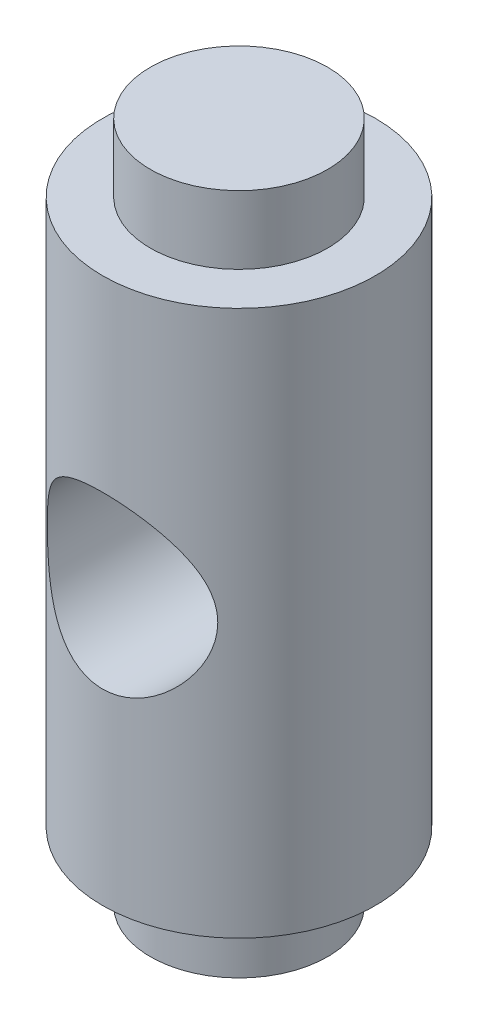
from build123d import *

# Parameters (mm, degrees)
M14X1_5_TAPPED_HOLE1_D     = 12.5
M14X1_5_TAPPED_HOLE1_DEPTH = 32.5
M14X1_5_TAPPED_HOLE1_TIP   = 3.755378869


with BuildPart() as part:
    # Sketch1 → Revolve1 (revolve)
    with BuildSketch(Plane.XY, mode=Mode.PRIVATE) as revolve1_sk:
        Polygon((0, 0), (0, 25), (-6.5, 25), (-6.5, 20), (-10, 20), (-10, -20), (-6.5, -20), (-6.5, -25), (0, -25), align=None)
    revolve(revolve1_sk.sketch.rotate(Axis((0, -25, 0), (0, 1, 0)), 270), axis=Axis((0, -25, 0), (0, 1, 0)))

    # M14x1.5 Tapped Hole1
    with Locations(Plane.XY.offset(12)):
        with Locations((0, 0)):
            Hole(M14X1_5_TAPPED_HOLE1_D / 2, depth=M14X1_5_TAPPED_HOLE1_DEPTH)
            with Locations((0, 0, -(M14X1_5_TAPPED_HOLE1_DEPTH + M14X1_5_TAPPED_HOLE1_TIP / 2))):  # 118° drill point
                Cone(0, M14X1_5_TAPPED_HOLE1_D / 2, M14X1_5_TAPPED_HOLE1_TIP, mode=Mode.SUBTRACT)


solid = part.part
